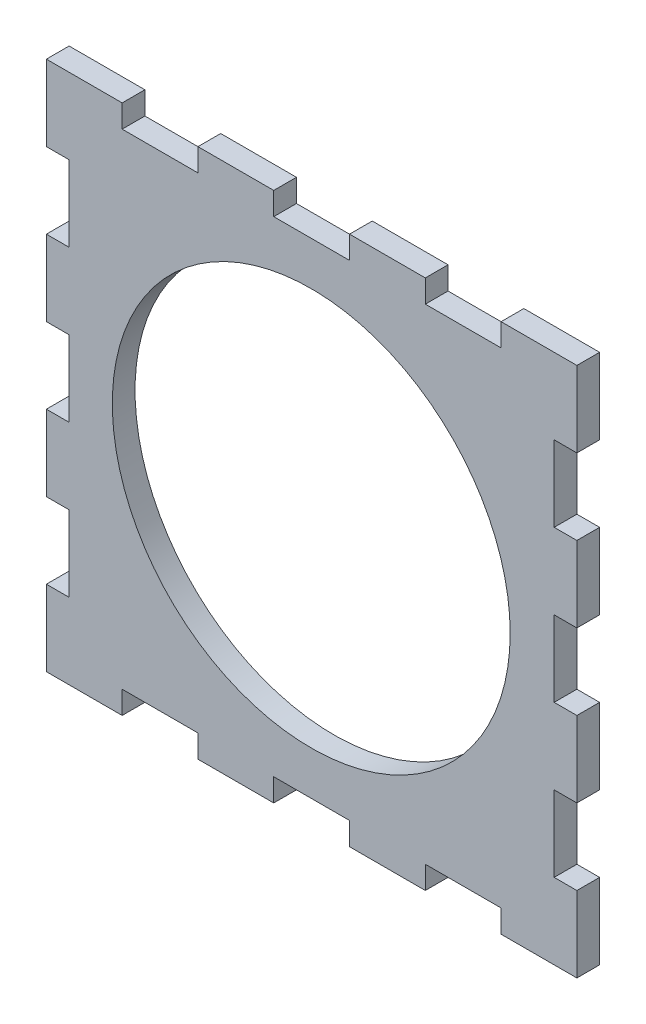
from build123d import *

# Parameters (mm, degrees)
SKETCH1_W           = 70
SKETCH1_H           = 70
BOSS_EXTRUDE1_DEPTH = 3
SKETCH2_W           = 10
SKETCH2_H           = 3
CUT_EXTRUDE1_DEPTH  = 3
SKETCH3_W           = 10
SKETCH3_H           = 3
CUT_EXTRUDE2_DEPTH  = 3
SKETCH4_W           = 3
SKETCH4_H           = 10
CUT_EXTRUDE3_DEPTH  = 3
SKETCH5_W           = 3
SKETCH5_H           = 10
CUT_EXTRUDE4_DEPTH  = 3
SKETCH6_R           = 26.25
CUT_EXTRUDE5_DEPTH  = 3


with BuildPart() as part:
    # Sketch1 → Boss-Extrude1 (new body)
    with BuildSketch(Plane.XY):
        with Locations((6.31147541, -21.803278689)):
            Rectangle(SKETCH1_W, SKETCH1_H)
    extrude(amount=BOSS_EXTRUDE1_DEPTH)

    # Sketch2 → Cut-Extrude1 (cut)
    with BuildSketch(Plane.XY.offset(3)):
        with Locations((-13.68852459, 11.696721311)):
            Rectangle(SKETCH2_W, SKETCH2_H)
        with Locations((6.31147541, 11.696721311)):
            Rectangle(SKETCH2_W, SKETCH2_H)
        with Locations((26.31147541, 11.696721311)):
            Rectangle(SKETCH2_W, SKETCH2_H)
    extrude(amount=-CUT_EXTRUDE1_DEPTH, mode=Mode.SUBTRACT)

    # Sketch3 → Cut-Extrude2 (cut)
    with BuildSketch(Plane.XY.offset(3)):
        with Locations((-13.68852459, -55.303278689)):
            Rectangle(SKETCH3_W, SKETCH3_H)
        with Locations((6.31147541, -55.303278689)):
            Rectangle(SKETCH3_W, SKETCH3_H)
        with Locations((26.31147541, -55.303278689)):
            Rectangle(SKETCH3_W, SKETCH3_H)
    extrude(amount=-CUT_EXTRUDE2_DEPTH, mode=Mode.SUBTRACT)

    # Sketch4 → Cut-Extrude3 (cut)
    with BuildSketch(Plane.XY.offset(3)):
        with Locations((-27.18852459, -1.803278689)):
            Rectangle(SKETCH4_W, SKETCH4_H)
        with Locations((-27.18852459, -21.803278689)):
            Rectangle(SKETCH4_W, SKETCH4_H)
        with Locations((-27.18852459, -41.803278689)):
            Rectangle(SKETCH4_W, SKETCH4_H)
    extrude(amount=-CUT_EXTRUDE3_DEPTH, mode=Mode.SUBTRACT)

    # Sketch5 → Cut-Extrude4 (cut)
    with BuildSketch(Plane.XY.offset(3)):
        with Locations((39.81147541, -1.803278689)):
            Rectangle(SKETCH5_W, SKETCH5_H)
        with Locations((39.81147541, -21.803278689)):
            Rectangle(SKETCH5_W, SKETCH5_H)
        with Locations((39.81147541, -41.803278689)):
            Rectangle(SKETCH5_W, SKETCH5_H)
    extrude(amount=-CUT_EXTRUDE4_DEPTH, mode=Mode.SUBTRACT)

    # Sketch6 → Cut-Extrude5 (cut)
    with BuildSketch(Plane.XY.offset(3)):
        with Locations((6.260476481, -21.803278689)):
            Circle(SKETCH6_R)
    extrude(amount=-CUT_EXTRUDE5_DEPTH, mode=Mode.SUBTRACT)


solid = part.part
